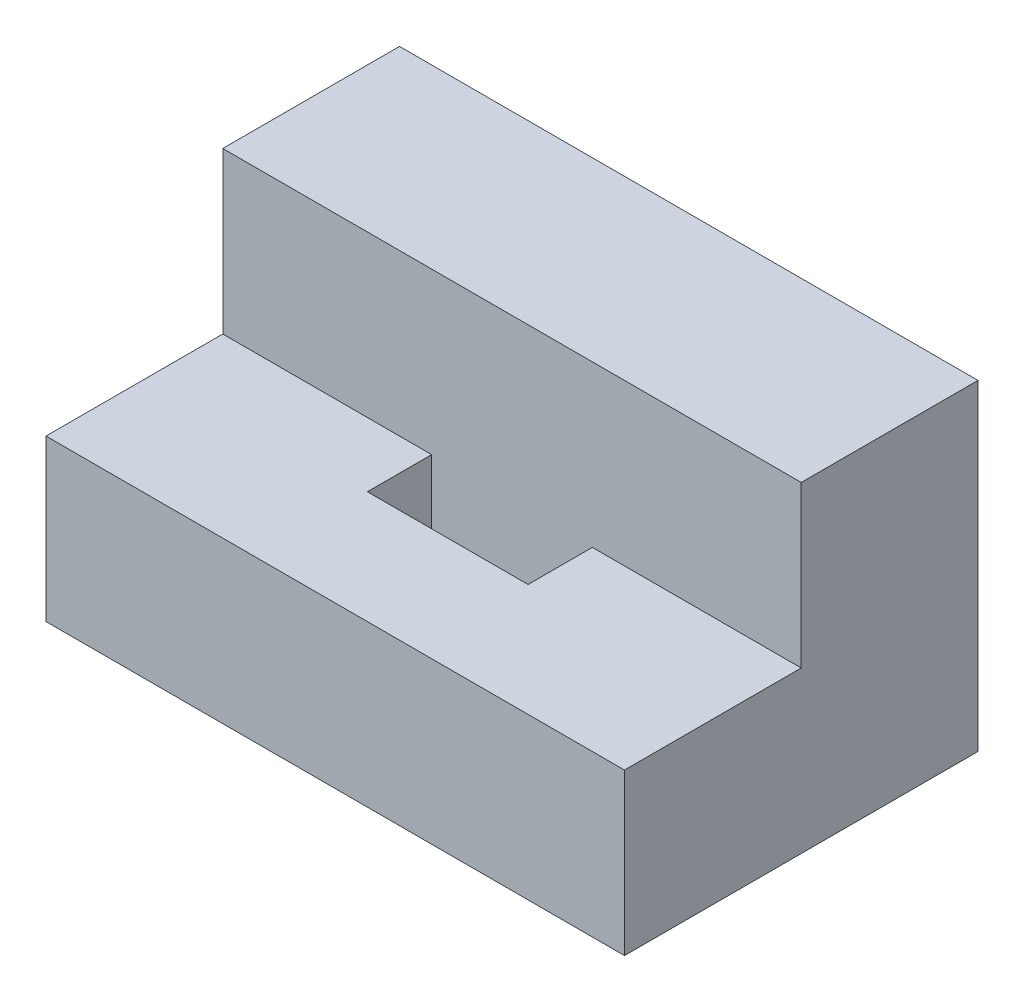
ISO-10303-21;
HEADER;
FILE_DESCRIPTION(('STEP AP214'),'2;1');
FILE_NAME('part.step','',(''),(''),'','','');
FILE_SCHEMA(('AUTOMOTIVE_DESIGN { 1 0 10303 214 1 1 1 1 }'));
ENDSEC;
DATA;
#1=APPLICATION_CONTEXT('core data for automotive mechanical design processes');
#2=APPLICATION_PROTOCOL_DEFINITION('international standard','automotive_design',2000,#1);
#3=PRODUCT_CONTEXT('',#1,'mechanical');
#4=PRODUCT('Part','Part','',(#3));
#5=PRODUCT_RELATED_PRODUCT_CATEGORY('part','',(#4));
#6=PRODUCT_DEFINITION_FORMATION('','',#4);
#7=PRODUCT_DEFINITION_CONTEXT('part definition',#1,'design');
#8=PRODUCT_DEFINITION('design','',#6,#7);
#9=PRODUCT_DEFINITION_SHAPE('','',#8);
#10=(LENGTH_UNIT() NAMED_UNIT(*) SI_UNIT(.MILLI.,.METRE.));
#11=(NAMED_UNIT(*) PLANE_ANGLE_UNIT() SI_UNIT($,.RADIAN.));
#12=(NAMED_UNIT(*) SI_UNIT($,.STERADIAN.) SOLID_ANGLE_UNIT());
#13=UNCERTAINTY_MEASURE_WITH_UNIT(LENGTH_MEASURE(1.E-05),#10,'distance_accuracy_value','');
#14=(GEOMETRIC_REPRESENTATION_CONTEXT(3) GLOBAL_UNCERTAINTY_ASSIGNED_CONTEXT((#13)) GLOBAL_UNIT_ASSIGNED_CONTEXT((#10,
#11,#12)) REPRESENTATION_CONTEXT('',''));
#15=CARTESIAN_POINT('',(0.,0.,0.));
#16=DIRECTION('',(0.,0.,1.));
#17=DIRECTION('',(1.,0.,0.));
#18=AXIS2_PLACEMENT_3D('',#15,#16,#17);
#19=CARTESIAN_POINT('',(0.,25.,-55.));
#20=DIRECTION('',(0.,-1.,0.));
#21=DIRECTION('',(0.,0.,-1.));
#22=AXIS2_PLACEMENT_3D('',#19,#20,#21);
#23=PLANE('',#22);
#24=DIRECTION('',(1.,0.,0.));
#25=VECTOR('',#24,1.);
#26=CARTESIAN_POINT('',(32.5,25.,-17.5));
#27=LINE('',#26,#25);
#28=CARTESIAN_POINT('',(32.5,25.,-17.5));
#29=VERTEX_POINT('',#28);
#30=CARTESIAN_POINT('',(57.5,25.,-17.5));
#31=VERTEX_POINT('',#30);
#32=EDGE_CURVE('E133',#29,#31,#27,.T.);
#33=ORIENTED_EDGE('',*,*,#32,.F.);
#34=DIRECTION('',(0.,0.,1.));
#35=VECTOR('',#34,1.);
#36=CARTESIAN_POINT('',(32.5,25.,-27.5));
#37=LINE('',#36,#35);
#38=CARTESIAN_POINT('',(32.5,25.,-27.5));
#39=VERTEX_POINT('',#38);
#40=EDGE_CURVE('E117',#39,#29,#37,.T.);
#41=ORIENTED_EDGE('',*,*,#40,.F.);
#42=DIRECTION('',(1.,0.,0.));
#43=VECTOR('',#42,1.);
#44=CARTESIAN_POINT('',(0.,25.,-27.5));
#45=LINE('',#44,#43);
#46=CARTESIAN_POINT('',(0.,25.,-27.5));
#47=VERTEX_POINT('',#46);
#48=EDGE_CURVE('E149',#47,#39,#45,.T.);
#49=ORIENTED_EDGE('',*,*,#48,.F.);
#50=DIRECTION('',(0.,0.,1.));
#51=VECTOR('',#50,1.);
#52=CARTESIAN_POINT('',(0.,25.,0.));
#53=LINE('',#52,#51);
#54=CARTESIAN_POINT('',(0.,25.,0.));
#55=VERTEX_POINT('',#54);
#56=EDGE_CURVE('E193',#47,#55,#53,.T.);
#57=ORIENTED_EDGE('',*,*,#56,.T.);
#58=DIRECTION('',(1.,0.,0.));
#59=VECTOR('',#58,1.);
#60=CARTESIAN_POINT('',(0.,25.,0.));
#61=LINE('',#60,#59);
#62=CARTESIAN_POINT('',(90.,25.,0.));
#63=VERTEX_POINT('',#62);
#64=EDGE_CURVE('E200',#55,#63,#61,.T.);
#65=ORIENTED_EDGE('',*,*,#64,.T.);
#66=DIRECTION('',(0.,0.,-1.));
#67=VECTOR('',#66,1.);
#68=CARTESIAN_POINT('',(90.,25.,0.));
#69=LINE('',#68,#67);
#70=CARTESIAN_POINT('',(90.,25.,-27.5));
#71=VERTEX_POINT('',#70);
#72=EDGE_CURVE('E166',#63,#71,#69,.T.);
#73=ORIENTED_EDGE('',*,*,#72,.T.);
#74=CARTESIAN_POINT('',(57.5,25.,-27.5));
#75=VERTEX_POINT('',#74);
#76=EDGE_CURVE('E35',#75,#71,#45,.T.);
#77=ORIENTED_EDGE('',*,*,#76,.F.);
#78=DIRECTION('',(0.,0.,-1.));
#79=VECTOR('',#78,1.);
#80=CARTESIAN_POINT('',(57.5,25.,-27.5));
#81=LINE('',#80,#79);
#82=EDGE_CURVE('E54',#31,#75,#81,.T.);
#83=ORIENTED_EDGE('',*,*,#82,.F.);
#84=EDGE_LOOP('',(#33,#41,#49,#57,#65,#73,#77,#83));
#85=FACE_BOUND('',#84,.T.);
#86=ADVANCED_FACE('F31',(#85),#23,.F.);
#87=CARTESIAN_POINT('',(0.,25.,0.));
#88=DIRECTION('',(1.,0.,0.));
#89=DIRECTION('',(0.,0.,-1.));
#90=AXIS2_PLACEMENT_3D('',#87,#88,#89);
#91=PLANE('',#90);
#92=DIRECTION('',(0.,0.,1.));
#93=VECTOR('',#92,1.);
#94=CARTESIAN_POINT('',(0.,0.,0.));
#95=LINE('',#94,#93);
#96=CARTESIAN_POINT('',(0.,0.,-55.));
#97=VERTEX_POINT('',#96);
#98=CARTESIAN_POINT('',(0.,0.,0.));
#99=VERTEX_POINT('',#98);
#100=EDGE_CURVE('E175',#97,#99,#95,.T.);
#101=ORIENTED_EDGE('',*,*,#100,.T.);
#102=DIRECTION('',(0.,-1.,0.));
#103=VECTOR('',#102,1.);
#104=CARTESIAN_POINT('',(0.,25.,0.));
#105=LINE('',#104,#103);
#106=EDGE_CURVE('E11',#55,#99,#105,.T.);
#107=ORIENTED_EDGE('',*,*,#106,.F.);
#108=ORIENTED_EDGE('',*,*,#56,.F.);
#109=DIRECTION('',(0.,-1.,0.));
#110=VECTOR('',#109,1.);
#111=CARTESIAN_POINT('',(0.,50.,-27.5));
#112=LINE('',#111,#110);
#113=CARTESIAN_POINT('',(0.,50.,-27.5));
#114=VERTEX_POINT('',#113);
#115=EDGE_CURVE('E171',#114,#47,#112,.T.);
#116=ORIENTED_EDGE('',*,*,#115,.F.);
#117=DIRECTION('',(0.,0.,1.));
#118=VECTOR('',#117,1.);
#119=CARTESIAN_POINT('',(0.,50.,-55.));
#120=LINE('',#119,#118);
#121=CARTESIAN_POINT('',(0.,50.,-55.));
#122=VERTEX_POINT('',#121);
#123=EDGE_CURVE('E145',#122,#114,#120,.T.);
#124=ORIENTED_EDGE('',*,*,#123,.F.);
#125=DIRECTION('',(0.,-1.,0.));
#126=VECTOR('',#125,1.);
#127=CARTESIAN_POINT('',(0.,25.,-55.));
#128=LINE('',#127,#126);
#129=EDGE_CURVE('E194',#122,#97,#128,.T.);
#130=ORIENTED_EDGE('',*,*,#129,.T.);
#131=EDGE_LOOP('',(#101,#107,#108,#116,#124,#130));
#132=FACE_BOUND('',#131,.T.);
#133=ADVANCED_FACE('F33',(#132),#91,.F.);
#134=CARTESIAN_POINT('',(0.,25.,0.));
#135=DIRECTION('',(0.,0.,-1.));
#136=DIRECTION('',(-1.,0.,0.));
#137=AXIS2_PLACEMENT_3D('',#134,#135,#136);
#138=PLANE('',#137);
#139=DIRECTION('',(1.,0.,0.));
#140=VECTOR('',#139,1.);
#141=CARTESIAN_POINT('',(0.,0.,0.));
#142=LINE('',#141,#140);
#143=CARTESIAN_POINT('',(90.,0.,0.));
#144=VERTEX_POINT('',#143);
#145=EDGE_CURVE('E180',#99,#144,#142,.T.);
#146=ORIENTED_EDGE('',*,*,#145,.T.);
#147=DIRECTION('',(0.,-1.,0.));
#148=VECTOR('',#147,1.);
#149=CARTESIAN_POINT('',(90.,25.,0.));
#150=LINE('',#149,#148);
#151=EDGE_CURVE('E41',#63,#144,#150,.T.);
#152=ORIENTED_EDGE('',*,*,#151,.F.);
#153=ORIENTED_EDGE('',*,*,#64,.F.);
#154=ORIENTED_EDGE('',*,*,#106,.T.);
#155=EDGE_LOOP('',(#146,#152,#153,#154));
#156=FACE_BOUND('',#155,.T.);
#157=ADVANCED_FACE('F228',(#156),#138,.F.);
#158=CARTESIAN_POINT('',(90.,25.,0.));
#159=DIRECTION('',(-1.,0.,0.));
#160=DIRECTION('',(0.,0.,1.));
#161=AXIS2_PLACEMENT_3D('',#158,#159,#160);
#162=PLANE('',#161);
#163=DIRECTION('',(0.,0.,-1.));
#164=VECTOR('',#163,1.);
#165=CARTESIAN_POINT('',(90.,0.,0.));
#166=LINE('',#165,#164);
#167=CARTESIAN_POINT('',(90.,0.,-55.));
#168=VERTEX_POINT('',#167);
#169=EDGE_CURVE('E186',#144,#168,#166,.T.);
#170=ORIENTED_EDGE('',*,*,#169,.T.);
#171=DIRECTION('',(0.,-1.,0.));
#172=VECTOR('',#171,1.);
#173=CARTESIAN_POINT('',(90.,25.,-55.));
#174=LINE('',#173,#172);
#175=CARTESIAN_POINT('',(90.,50.,-55.));
#176=VERTEX_POINT('',#175);
#177=EDGE_CURVE('E196',#176,#168,#174,.T.);
#178=ORIENTED_EDGE('',*,*,#177,.F.);
#179=DIRECTION('',(0.,0.,-1.));
#180=VECTOR('',#179,1.);
#181=CARTESIAN_POINT('',(90.,50.,-55.));
#182=LINE('',#181,#180);
#183=CARTESIAN_POINT('',(90.,50.,-27.5));
#184=VERTEX_POINT('',#183);
#185=EDGE_CURVE('E151',#184,#176,#182,.T.);
#186=ORIENTED_EDGE('',*,*,#185,.F.);
#187=DIRECTION('',(0.,-1.,0.));
#188=VECTOR('',#187,1.);
#189=CARTESIAN_POINT('',(90.,50.,-27.5));
#190=LINE('',#189,#188);
#191=EDGE_CURVE('E156',#184,#71,#190,.T.);
#192=ORIENTED_EDGE('',*,*,#191,.T.);
#193=ORIENTED_EDGE('',*,*,#72,.F.);
#194=ORIENTED_EDGE('',*,*,#151,.T.);
#195=EDGE_LOOP('',(#170,#178,#186,#192,#193,#194));
#196=FACE_BOUND('',#195,.T.);
#197=ADVANCED_FACE('F211',(#196),#162,.F.);
#198=CARTESIAN_POINT('',(0.,25.,-55.));
#199=DIRECTION('',(0.,0.,1.));
#200=DIRECTION('',(1.,0.,0.));
#201=AXIS2_PLACEMENT_3D('',#198,#199,#200);
#202=PLANE('',#201);
#203=DIRECTION('',(-1.,0.,0.));
#204=VECTOR('',#203,1.);
#205=CARTESIAN_POINT('',(0.,0.,-55.));
#206=LINE('',#205,#204);
#207=EDGE_CURVE('E191',#168,#97,#206,.T.);
#208=ORIENTED_EDGE('',*,*,#207,.T.);
#209=ORIENTED_EDGE('',*,*,#129,.F.);
#210=DIRECTION('',(-1.,0.,0.));
#211=VECTOR('',#210,1.);
#212=CARTESIAN_POINT('',(0.,50.,-55.));
#213=LINE('',#212,#211);
#214=EDGE_CURVE('E154',#176,#122,#213,.T.);
#215=ORIENTED_EDGE('',*,*,#214,.F.);
#216=ORIENTED_EDGE('',*,*,#177,.T.);
#217=EDGE_LOOP('',(#208,#209,#215,#216));
#218=FACE_BOUND('',#217,.T.);
#219=ADVANCED_FACE('F234',(#218),#202,.F.);
#220=CARTESIAN_POINT('',(0.,0.,-55.));
#221=DIRECTION('',(0.,-1.,0.));
#222=DIRECTION('',(0.,0.,-1.));
#223=AXIS2_PLACEMENT_3D('',#220,#221,#222);
#224=PLANE('',#223);
#225=DIRECTION('',(0.,0.,1.));
#226=VECTOR('',#225,1.);
#227=CARTESIAN_POINT('',(32.5,0.,-27.5));
#228=LINE('',#227,#226);
#229=CARTESIAN_POINT('',(32.5,0.,-27.5));
#230=VERTEX_POINT('',#229);
#231=CARTESIAN_POINT('',(32.5,0.,-17.5));
#232=VERTEX_POINT('',#231);
#233=EDGE_CURVE('E114',#230,#232,#228,.T.);
#234=ORIENTED_EDGE('',*,*,#233,.T.);
#235=DIRECTION('',(1.,0.,0.));
#236=VECTOR('',#235,1.);
#237=CARTESIAN_POINT('',(32.5,0.,-17.5));
#238=LINE('',#237,#236);
#239=CARTESIAN_POINT('',(57.5,0.,-17.5));
#240=VERTEX_POINT('',#239);
#241=EDGE_CURVE('E125',#232,#240,#238,.T.);
#242=ORIENTED_EDGE('',*,*,#241,.T.);
#243=DIRECTION('',(0.,0.,-1.));
#244=VECTOR('',#243,1.);
#245=CARTESIAN_POINT('',(57.5,0.,-27.5));
#246=LINE('',#245,#244);
#247=CARTESIAN_POINT('',(57.5,0.,-27.5));
#248=VERTEX_POINT('',#247);
#249=EDGE_CURVE('E49',#240,#248,#246,.T.);
#250=ORIENTED_EDGE('',*,*,#249,.T.);
#251=DIRECTION('',(-1.,0.,0.));
#252=VECTOR('',#251,1.);
#253=CARTESIAN_POINT('',(32.5,0.,-27.5));
#254=LINE('',#253,#252);
#255=EDGE_CURVE('E122',#248,#230,#254,.T.);
#256=ORIENTED_EDGE('',*,*,#255,.T.);
#257=EDGE_LOOP('',(#234,#242,#250,#256));
#258=FACE_BOUND('',#257,.T.);
#259=ORIENTED_EDGE('',*,*,#100,.F.);
#260=ORIENTED_EDGE('',*,*,#207,.F.);
#261=ORIENTED_EDGE('',*,*,#169,.F.);
#262=ORIENTED_EDGE('',*,*,#145,.F.);
#263=EDGE_LOOP('',(#259,#260,#261,#262));
#264=FACE_BOUND('',#263,.T.);
#265=ADVANCED_FACE('F129',(#258,#264),#224,.T.);
#266=CARTESIAN_POINT('',(0.,50.,-27.5));
#267=DIRECTION('',(0.,0.,-1.));
#268=DIRECTION('',(-1.,0.,0.));
#269=AXIS2_PLACEMENT_3D('',#266,#267,#268);
#270=PLANE('',#269);
#271=ORIENTED_EDGE('',*,*,#48,.T.);
#272=DIRECTION('',(0.,1.,0.));
#273=VECTOR('',#272,1.);
#274=CARTESIAN_POINT('',(32.5,0.,-27.5));
#275=LINE('',#274,#273);
#276=EDGE_CURVE('E140',#230,#39,#275,.T.);
#277=ORIENTED_EDGE('',*,*,#276,.F.);
#278=ORIENTED_EDGE('',*,*,#255,.F.);
#279=DIRECTION('',(0.,1.,0.));
#280=VECTOR('',#279,1.);
#281=CARTESIAN_POINT('',(57.5,0.,-27.5));
#282=LINE('',#281,#280);
#283=EDGE_CURVE('E142',#248,#75,#282,.T.);
#284=ORIENTED_EDGE('',*,*,#283,.T.);
#285=ORIENTED_EDGE('',*,*,#76,.T.);
#286=ORIENTED_EDGE('',*,*,#191,.F.);
#287=DIRECTION('',(1.,0.,0.));
#288=VECTOR('',#287,1.);
#289=CARTESIAN_POINT('',(0.,50.,-27.5));
#290=LINE('',#289,#288);
#291=EDGE_CURVE('E148',#114,#184,#290,.T.);
#292=ORIENTED_EDGE('',*,*,#291,.F.);
#293=ORIENTED_EDGE('',*,*,#115,.T.);
#294=EDGE_LOOP('',(#271,#277,#278,#284,#285,#286,#292,#293));
#295=FACE_BOUND('',#294,.T.);
#296=ADVANCED_FACE('F212',(#295),#270,.F.);
#297=CARTESIAN_POINT('',(0.,50.,-27.5));
#298=DIRECTION('',(0.,1.,0.));
#299=DIRECTION('',(0.,0.,1.));
#300=AXIS2_PLACEMENT_3D('',#297,#298,#299);
#301=PLANE('',#300);
#302=ORIENTED_EDGE('',*,*,#123,.T.);
#303=ORIENTED_EDGE('',*,*,#291,.T.);
#304=ORIENTED_EDGE('',*,*,#185,.T.);
#305=ORIENTED_EDGE('',*,*,#214,.T.);
#306=EDGE_LOOP('',(#302,#303,#304,#305));
#307=FACE_BOUND('',#306,.T.);
#308=ADVANCED_FACE('F221',(#307),#301,.T.);
#309=CARTESIAN_POINT('',(32.5,0.,-27.5));
#310=DIRECTION('',(-1.,0.,0.));
#311=DIRECTION('',(0.,0.,1.));
#312=AXIS2_PLACEMENT_3D('',#309,#310,#311);
#313=PLANE('',#312);
#314=ORIENTED_EDGE('',*,*,#40,.T.);
#315=DIRECTION('',(0.,1.,0.));
#316=VECTOR('',#315,1.);
#317=CARTESIAN_POINT('',(32.5,0.,-17.5));
#318=LINE('',#317,#316);
#319=EDGE_CURVE('E110',#232,#29,#318,.T.);
#320=ORIENTED_EDGE('',*,*,#319,.F.);
#321=ORIENTED_EDGE('',*,*,#233,.F.);
#322=ORIENTED_EDGE('',*,*,#276,.T.);
#323=EDGE_LOOP('',(#314,#320,#321,#322));
#324=FACE_BOUND('',#323,.T.);
#325=ADVANCED_FACE('F112',(#324),#313,.F.);
#326=CARTESIAN_POINT('',(57.5,0.,-27.5));
#327=DIRECTION('',(1.,0.,0.));
#328=DIRECTION('',(0.,0.,-1.));
#329=AXIS2_PLACEMENT_3D('',#326,#327,#328);
#330=PLANE('',#329);
#331=ORIENTED_EDGE('',*,*,#82,.T.);
#332=ORIENTED_EDGE('',*,*,#283,.F.);
#333=ORIENTED_EDGE('',*,*,#249,.F.);
#334=DIRECTION('',(0.,1.,0.));
#335=VECTOR('',#334,1.);
#336=CARTESIAN_POINT('',(57.5,0.,-17.5));
#337=LINE('',#336,#335);
#338=EDGE_CURVE('E121',#240,#31,#337,.T.);
#339=ORIENTED_EDGE('',*,*,#338,.T.);
#340=EDGE_LOOP('',(#331,#332,#333,#339));
#341=FACE_BOUND('',#340,.T.);
#342=ADVANCED_FACE('F213',(#341),#330,.F.);
#343=CARTESIAN_POINT('',(32.5,0.,-17.5));
#344=DIRECTION('',(0.,0.,1.));
#345=DIRECTION('',(1.,0.,0.));
#346=AXIS2_PLACEMENT_3D('',#343,#344,#345);
#347=PLANE('',#346);
#348=ORIENTED_EDGE('',*,*,#32,.T.);
#349=ORIENTED_EDGE('',*,*,#338,.F.);
#350=ORIENTED_EDGE('',*,*,#241,.F.);
#351=ORIENTED_EDGE('',*,*,#319,.T.);
#352=EDGE_LOOP('',(#348,#349,#350,#351));
#353=FACE_BOUND('',#352,.T.);
#354=ADVANCED_FACE('F126',(#353),#347,.F.);
#355=CLOSED_SHELL('',(#86,#133,#157,#197,#219,#265,#296,#308,#325,#342,#354));
#356=MANIFOLD_SOLID_BREP('B2',#355);
#357=ADVANCED_BREP_SHAPE_REPRESENTATION('',(#18,#356),#14);
#358=SHAPE_DEFINITION_REPRESENTATION(#9,#357);
ENDSEC;
END-ISO-10303-21;
